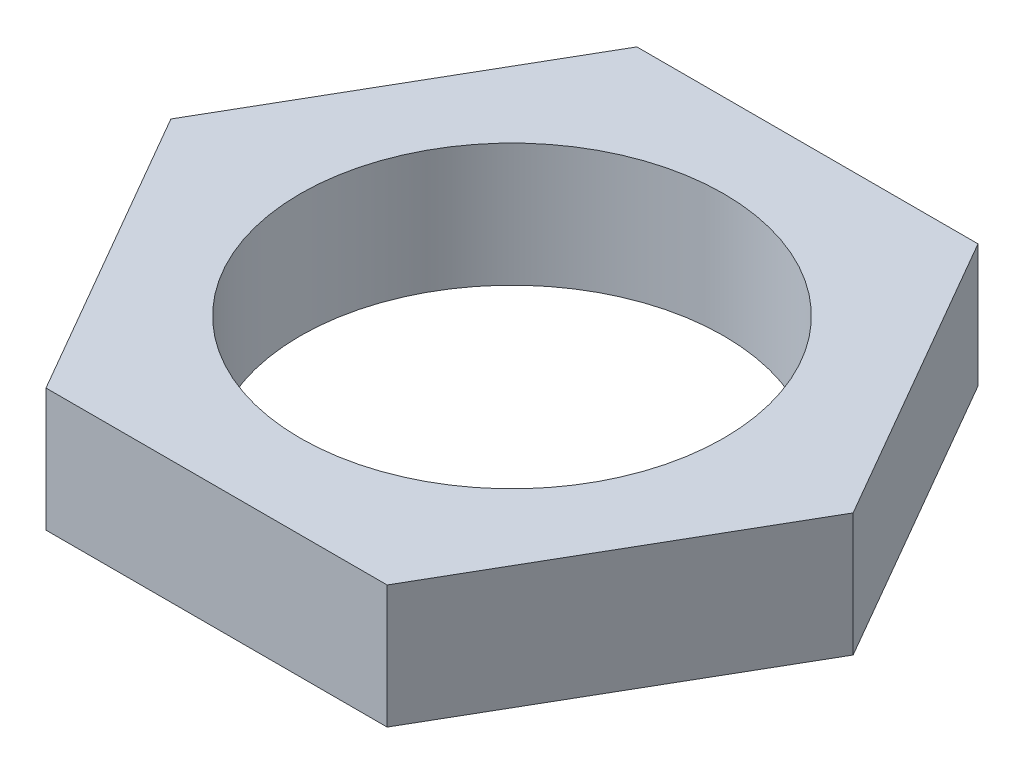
from build123d import *

# Parameters (mm, degrees)
ESQUISSE1_R      = 8.6
EXTRUSION1_DEPTH = 5


with BuildPart() as part:
    # Esquisse1 → Extrusion1 (new body)
    with BuildSketch(Plane(origin=(0, 0, 0), x_dir=(1, 0, 0), z_dir=(0, 1, 0))):
        Polygon((6.92820323, -12), (13.856406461, 0), (6.92820323, 12), (-6.92820323, 12), (-13.856406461, 0), (-6.92820323, -12), align=None)
        with Locations(Location((0, 0, 0), (0, 0, 270))):
            Circle(ESQUISSE1_R, mode=Mode.SUBTRACT)
    extrude(amount=EXTRUSION1_DEPTH)


solid = part.part
